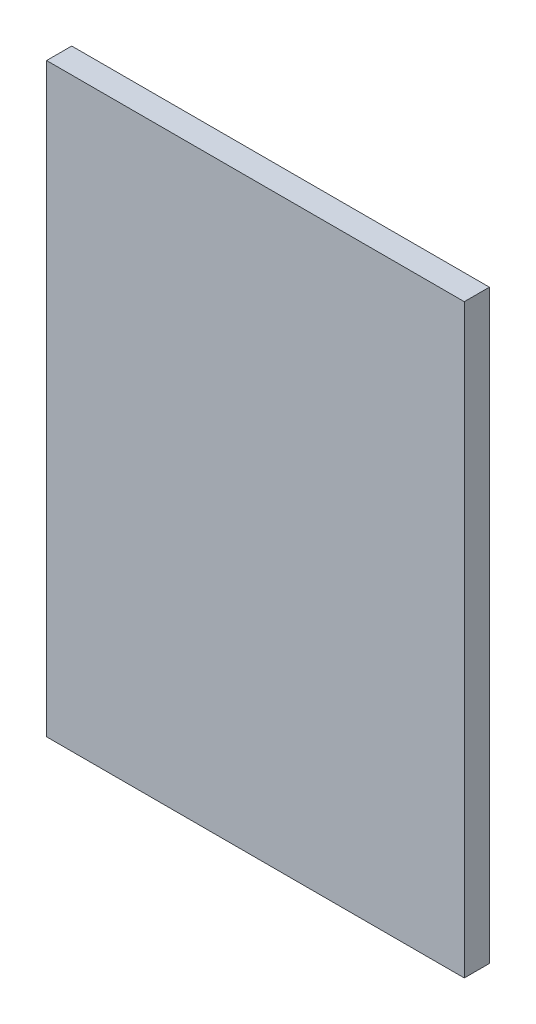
ISO-10303-21;
HEADER;
FILE_DESCRIPTION(('STEP AP214'),'2;1');
FILE_NAME('part.step','',(''),(''),'','','');
FILE_SCHEMA(('AUTOMOTIVE_DESIGN { 1 0 10303 214 1 1 1 1 }'));
ENDSEC;
DATA;
#1=APPLICATION_CONTEXT('core data for automotive mechanical design processes');
#2=APPLICATION_PROTOCOL_DEFINITION('international standard','automotive_design',2000,#1);
#3=PRODUCT_CONTEXT('',#1,'mechanical');
#4=PRODUCT('Part','Part','',(#3));
#5=PRODUCT_RELATED_PRODUCT_CATEGORY('part','',(#4));
#6=PRODUCT_DEFINITION_FORMATION('','',#4);
#7=PRODUCT_DEFINITION_CONTEXT('part definition',#1,'design');
#8=PRODUCT_DEFINITION('design','',#6,#7);
#9=PRODUCT_DEFINITION_SHAPE('','',#8);
#10=(LENGTH_UNIT() NAMED_UNIT(*) SI_UNIT(.MILLI.,.METRE.));
#11=(NAMED_UNIT(*) PLANE_ANGLE_UNIT() SI_UNIT($,.RADIAN.));
#12=(NAMED_UNIT(*) SI_UNIT($,.STERADIAN.) SOLID_ANGLE_UNIT());
#13=UNCERTAINTY_MEASURE_WITH_UNIT(LENGTH_MEASURE(1.E-05),#10,'distance_accuracy_value','');
#14=(GEOMETRIC_REPRESENTATION_CONTEXT(3) GLOBAL_UNCERTAINTY_ASSIGNED_CONTEXT((#13)) GLOBAL_UNIT_ASSIGNED_CONTEXT((#10,
#11,#12)) REPRESENTATION_CONTEXT('',''));
#15=CARTESIAN_POINT('',(0.,0.,0.));
#16=DIRECTION('',(0.,0.,1.));
#17=DIRECTION('',(1.,0.,0.));
#18=AXIS2_PLACEMENT_3D('',#15,#16,#17);
#19=CARTESIAN_POINT('',(133.,186.5,16.));
#20=DIRECTION('',(-1.,0.,0.));
#21=DIRECTION('',(0.,-1.,0.));
#22=AXIS2_PLACEMENT_3D('',#19,#20,#21);
#23=PLANE('',#22);
#24=DIRECTION('',(0.,1.,0.));
#25=VECTOR('',#24,1.);
#26=CARTESIAN_POINT('',(133.,186.5,0.));
#27=LINE('',#26,#25);
#28=CARTESIAN_POINT('',(133.,-186.5,0.));
#29=VERTEX_POINT('',#28);
#30=CARTESIAN_POINT('',(133.,186.5,0.));
#31=VERTEX_POINT('',#30);
#32=EDGE_CURVE('E94',#29,#31,#27,.T.);
#33=ORIENTED_EDGE('',*,*,#32,.T.);
#34=DIRECTION('',(0.,0.,-1.));
#35=VECTOR('',#34,1.);
#36=CARTESIAN_POINT('',(133.,186.5,16.));
#37=LINE('',#36,#35);
#38=CARTESIAN_POINT('',(133.,186.5,16.));
#39=VERTEX_POINT('',#38);
#40=EDGE_CURVE('E11',#39,#31,#37,.T.);
#41=ORIENTED_EDGE('',*,*,#40,.F.);
#42=DIRECTION('',(0.,1.,0.));
#43=VECTOR('',#42,1.);
#44=CARTESIAN_POINT('',(133.,186.5,16.));
#45=LINE('',#44,#43);
#46=CARTESIAN_POINT('',(133.,-186.5,16.));
#47=VERTEX_POINT('',#46);
#48=EDGE_CURVE('E82',#47,#39,#45,.T.);
#49=ORIENTED_EDGE('',*,*,#48,.F.);
#50=DIRECTION('',(0.,0.,-1.));
#51=VECTOR('',#50,1.);
#52=CARTESIAN_POINT('',(133.,-186.5,16.));
#53=LINE('',#52,#51);
#54=EDGE_CURVE('E90',#47,#29,#53,.T.);
#55=ORIENTED_EDGE('',*,*,#54,.T.);
#56=EDGE_LOOP('',(#33,#41,#49,#55));
#57=FACE_BOUND('',#56,.T.);
#58=ADVANCED_FACE('F31',(#57),#23,.F.);
#59=CARTESIAN_POINT('',(-133.,186.5,16.));
#60=DIRECTION('',(0.,-1.,0.));
#61=DIRECTION('',(0.,0.,-1.));
#62=AXIS2_PLACEMENT_3D('',#59,#60,#61);
#63=PLANE('',#62);
#64=DIRECTION('',(-1.,0.,0.));
#65=VECTOR('',#64,1.);
#66=CARTESIAN_POINT('',(-133.,186.5,0.));
#67=LINE('',#66,#65);
#68=CARTESIAN_POINT('',(-133.,186.5,0.));
#69=VERTEX_POINT('',#68);
#70=EDGE_CURVE('E86',#31,#69,#67,.T.);
#71=ORIENTED_EDGE('',*,*,#70,.T.);
#72=DIRECTION('',(0.,0.,-1.));
#73=VECTOR('',#72,1.);
#74=CARTESIAN_POINT('',(-133.,186.5,16.));
#75=LINE('',#74,#73);
#76=CARTESIAN_POINT('',(-133.,186.5,16.));
#77=VERTEX_POINT('',#76);
#78=EDGE_CURVE('E39',#77,#69,#75,.T.);
#79=ORIENTED_EDGE('',*,*,#78,.F.);
#80=DIRECTION('',(-1.,0.,0.));
#81=VECTOR('',#80,1.);
#82=CARTESIAN_POINT('',(-133.,186.5,16.));
#83=LINE('',#82,#81);
#84=EDGE_CURVE('E77',#39,#77,#83,.T.);
#85=ORIENTED_EDGE('',*,*,#84,.F.);
#86=ORIENTED_EDGE('',*,*,#40,.T.);
#87=EDGE_LOOP('',(#71,#79,#85,#86));
#88=FACE_BOUND('',#87,.T.);
#89=ADVANCED_FACE('F85',(#88),#63,.F.);
#90=CARTESIAN_POINT('',(-133.,186.5,16.));
#91=DIRECTION('',(1.,0.,0.));
#92=DIRECTION('',(0.,1.,0.));
#93=AXIS2_PLACEMENT_3D('',#90,#91,#92);
#94=PLANE('',#93);
#95=DIRECTION('',(0.,-1.,0.));
#96=VECTOR('',#95,1.);
#97=CARTESIAN_POINT('',(-133.,186.5,0.));
#98=LINE('',#97,#96);
#99=CARTESIAN_POINT('',(-133.,-186.5,0.));
#100=VERTEX_POINT('',#99);
#101=EDGE_CURVE('E64',#69,#100,#98,.T.);
#102=ORIENTED_EDGE('',*,*,#101,.T.);
#103=DIRECTION('',(0.,0.,-1.));
#104=VECTOR('',#103,1.);
#105=CARTESIAN_POINT('',(-133.,-186.5,16.));
#106=LINE('',#105,#104);
#107=CARTESIAN_POINT('',(-133.,-186.5,16.));
#108=VERTEX_POINT('',#107);
#109=EDGE_CURVE('E87',#108,#100,#106,.T.);
#110=ORIENTED_EDGE('',*,*,#109,.F.);
#111=DIRECTION('',(0.,-1.,0.));
#112=VECTOR('',#111,1.);
#113=CARTESIAN_POINT('',(-133.,186.5,16.));
#114=LINE('',#113,#112);
#115=EDGE_CURVE('E80',#77,#108,#114,.T.);
#116=ORIENTED_EDGE('',*,*,#115,.F.);
#117=ORIENTED_EDGE('',*,*,#78,.T.);
#118=EDGE_LOOP('',(#102,#110,#116,#117));
#119=FACE_BOUND('',#118,.T.);
#120=ADVANCED_FACE('F88',(#119),#94,.F.);
#121=CARTESIAN_POINT('',(-133.,-186.5,16.));
#122=DIRECTION('',(0.,1.,0.));
#123=DIRECTION('',(-1.,0.,0.));
#124=AXIS2_PLACEMENT_3D('',#121,#122,#123);
#125=PLANE('',#124);
#126=DIRECTION('',(1.,0.,0.));
#127=VECTOR('',#126,1.);
#128=CARTESIAN_POINT('',(-133.,-186.5,0.));
#129=LINE('',#128,#127);
#130=EDGE_CURVE('E70',#100,#29,#129,.T.);
#131=ORIENTED_EDGE('',*,*,#130,.T.);
#132=ORIENTED_EDGE('',*,*,#54,.F.);
#133=DIRECTION('',(1.,0.,0.));
#134=VECTOR('',#133,1.);
#135=CARTESIAN_POINT('',(-133.,-186.5,16.));
#136=LINE('',#135,#134);
#137=EDGE_CURVE('E47',#108,#47,#136,.T.);
#138=ORIENTED_EDGE('',*,*,#137,.F.);
#139=ORIENTED_EDGE('',*,*,#109,.T.);
#140=EDGE_LOOP('',(#131,#132,#138,#139));
#141=FACE_BOUND('',#140,.T.);
#142=ADVANCED_FACE('F101',(#141),#125,.F.);
#143=CARTESIAN_POINT('',(133.,-186.5,16.));
#144=DIRECTION('',(0.,0.,1.));
#145=DIRECTION('',(1.,0.,0.));
#146=AXIS2_PLACEMENT_3D('',#143,#144,#145);
#147=PLANE('',#146);
#148=ORIENTED_EDGE('',*,*,#48,.T.);
#149=ORIENTED_EDGE('',*,*,#84,.T.);
#150=ORIENTED_EDGE('',*,*,#115,.T.);
#151=ORIENTED_EDGE('',*,*,#137,.T.);
#152=EDGE_LOOP('',(#148,#149,#150,#151));
#153=FACE_BOUND('',#152,.T.);
#154=ADVANCED_FACE('F78',(#153),#147,.T.);
#155=CARTESIAN_POINT('',(133.,-186.5,0.));
#156=DIRECTION('',(0.,0.,1.));
#157=DIRECTION('',(1.,0.,0.));
#158=AXIS2_PLACEMENT_3D('',#155,#156,#157);
#159=PLANE('',#158);
#160=ORIENTED_EDGE('',*,*,#32,.F.);
#161=ORIENTED_EDGE('',*,*,#130,.F.);
#162=ORIENTED_EDGE('',*,*,#101,.F.);
#163=ORIENTED_EDGE('',*,*,#70,.F.);
#164=EDGE_LOOP('',(#160,#161,#162,#163));
#165=FACE_BOUND('',#164,.T.);
#166=ADVANCED_FACE('F104',(#165),#159,.F.);
#167=CLOSED_SHELL('',(#58,#89,#120,#142,#154,#166));
#168=MANIFOLD_SOLID_BREP('B2',#167);
#169=ADVANCED_BREP_SHAPE_REPRESENTATION('',(#18,#168),#14);
#170=SHAPE_DEFINITION_REPRESENTATION(#9,#169);
ENDSEC;
END-ISO-10303-21;
